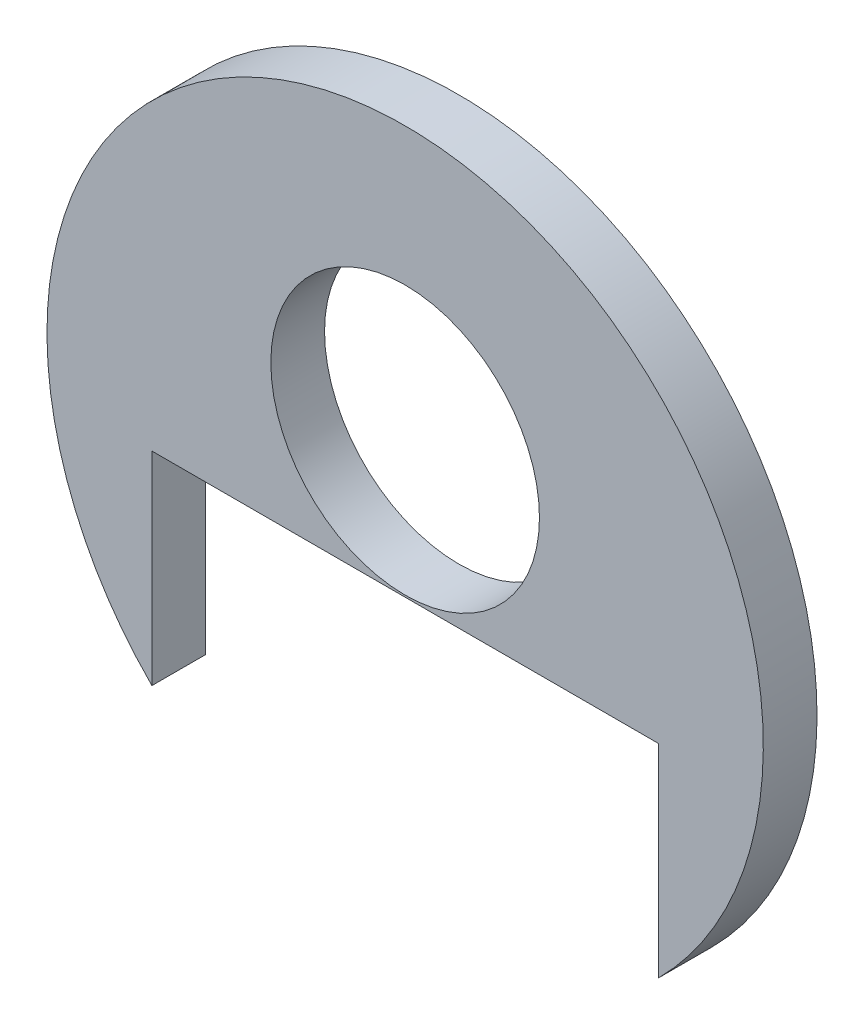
ISO-10303-21;
HEADER;
FILE_DESCRIPTION(('STEP AP214'),'2;1');
FILE_NAME('part.step','',(''),(''),'','','');
FILE_SCHEMA(('AUTOMOTIVE_DESIGN { 1 0 10303 214 1 1 1 1 }'));
ENDSEC;
DATA;
#1=APPLICATION_CONTEXT('core data for automotive mechanical design processes');
#2=APPLICATION_PROTOCOL_DEFINITION('international standard','automotive_design',2000,#1);
#3=PRODUCT_CONTEXT('',#1,'mechanical');
#4=PRODUCT('Part','Part','',(#3));
#5=PRODUCT_RELATED_PRODUCT_CATEGORY('part','',(#4));
#6=PRODUCT_DEFINITION_FORMATION('','',#4);
#7=PRODUCT_DEFINITION_CONTEXT('part definition',#1,'design');
#8=PRODUCT_DEFINITION('design','',#6,#7);
#9=PRODUCT_DEFINITION_SHAPE('','',#8);
#10=(LENGTH_UNIT() NAMED_UNIT(*) SI_UNIT(.MILLI.,.METRE.));
#11=(NAMED_UNIT(*) PLANE_ANGLE_UNIT() SI_UNIT($,.RADIAN.));
#12=(NAMED_UNIT(*) SI_UNIT($,.STERADIAN.) SOLID_ANGLE_UNIT());
#13=UNCERTAINTY_MEASURE_WITH_UNIT(LENGTH_MEASURE(1.E-05),#10,'distance_accuracy_value','');
#14=(GEOMETRIC_REPRESENTATION_CONTEXT(3) GLOBAL_UNCERTAINTY_ASSIGNED_CONTEXT((#13)) GLOBAL_UNIT_ASSIGNED_CONTEXT((#10,
#11,#12)) REPRESENTATION_CONTEXT('',''));
#15=CARTESIAN_POINT('',(0.,0.,0.));
#16=DIRECTION('',(0.,0.,1.));
#17=DIRECTION('',(1.,0.,0.));
#18=AXIS2_PLACEMENT_3D('',#15,#16,#17);
#19=CARTESIAN_POINT('',(0.,0.,-3.81));
#20=DIRECTION('',(0.,0.,1.));
#21=DIRECTION('',(1.,0.,0.));
#22=AXIS2_PLACEMENT_3D('',#19,#20,#21);
#23=CYLINDRICAL_SURFACE('',#22,25.4);
#24=DIRECTION('',(0.,0.,1.));
#25=VECTOR('',#24,1.);
#26=CARTESIAN_POINT('',(-17.9578,-17.963224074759,-3.81));
#27=LINE('',#26,#25);
#28=CARTESIAN_POINT('',(-17.9578,-17.963224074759,0.));
#29=VERTEX_POINT('',#28);
#30=CARTESIAN_POINT('',(-17.9578,-17.963224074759,-3.81));
#31=VERTEX_POINT('',#30);
#32=EDGE_CURVE('E52',#29,#31,#27,.F.);
#33=ORIENTED_EDGE('',*,*,#32,.F.);
#34=CARTESIAN_POINT('',(0.,0.,0.));
#35=DIRECTION('',(0.,0.,1.));
#36=DIRECTION('',(1.,0.,0.));
#37=AXIS2_PLACEMENT_3D('',#34,#35,#36);
#38=CIRCLE('',#37,25.4);
#39=CARTESIAN_POINT('',(17.9578,-17.963224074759,0.));
#40=VERTEX_POINT('',#39);
#41=EDGE_CURVE('E106',#40,#29,#38,.T.);
#42=ORIENTED_EDGE('',*,*,#41,.F.);
#43=DIRECTION('',(0.,0.,1.));
#44=VECTOR('',#43,1.);
#45=CARTESIAN_POINT('',(17.9578,-17.963224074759,-3.81));
#46=LINE('',#45,#44);
#47=CARTESIAN_POINT('',(17.9578,-17.963224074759,-3.81));
#48=VERTEX_POINT('',#47);
#49=EDGE_CURVE('E44',#48,#40,#46,.T.);
#50=ORIENTED_EDGE('',*,*,#49,.F.);
#51=CARTESIAN_POINT('',(0.,0.,-3.81));
#52=DIRECTION('',(0.,0.,1.));
#53=DIRECTION('',(1.,0.,0.));
#54=AXIS2_PLACEMENT_3D('',#51,#52,#53);
#55=CIRCLE('',#54,25.4);
#56=EDGE_CURVE('E38',#48,#31,#55,.T.);
#57=ORIENTED_EDGE('',*,*,#56,.T.);
#58=EDGE_LOOP('',(#33,#42,#50,#57));
#59=FACE_BOUND('',#58,.T.);
#60=ADVANCED_FACE('F31',(#59),#23,.T.);
#61=CARTESIAN_POINT('',(0.,0.,-3.81));
#62=DIRECTION('',(0.,0.,1.));
#63=DIRECTION('',(1.,0.,0.));
#64=AXIS2_PLACEMENT_3D('',#61,#62,#63);
#65=PLANE('',#64);
#66=CARTESIAN_POINT('',(0.,6.096,-3.81));
#67=DIRECTION('',(0.,0.,1.));
#68=DIRECTION('',(1.,0.,0.));
#69=AXIS2_PLACEMENT_3D('',#66,#67,#68);
#70=CIRCLE('',#69,9.525);
#71=CARTESIAN_POINT('',(9.525,6.096,-3.81));
#72=VERTEX_POINT('',#71);
#73=EDGE_CURVE('E103',#72,#72,#70,.T.);
#74=ORIENTED_EDGE('',*,*,#73,.T.);
#75=EDGE_LOOP('',(#74));
#76=FACE_BOUND('',#75,.T.);
#77=DIRECTION('',(-1.,0.,0.));
#78=VECTOR('',#77,1.);
#79=CARTESIAN_POINT('',(-17.9578,-3.556,-3.81));
#80=LINE('',#79,#78);
#81=CARTESIAN_POINT('',(17.9578,-3.556,-3.81));
#82=VERTEX_POINT('',#81);
#83=CARTESIAN_POINT('',(-17.9578,-3.556,-3.81));
#84=VERTEX_POINT('',#83);
#85=EDGE_CURVE('E82',#82,#84,#80,.T.);
#86=ORIENTED_EDGE('',*,*,#85,.T.);
#87=DIRECTION('',(0.,-1.,0.));
#88=VECTOR('',#87,1.);
#89=CARTESIAN_POINT('',(-17.9578,-3.556,-3.81));
#90=LINE('',#89,#88);
#91=EDGE_CURVE('E89',#84,#31,#90,.T.);
#92=ORIENTED_EDGE('',*,*,#91,.T.);
#93=ORIENTED_EDGE('',*,*,#56,.F.);
#94=DIRECTION('',(0.,1.,0.));
#95=VECTOR('',#94,1.);
#96=CARTESIAN_POINT('',(17.9578,-28.1051693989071,-3.81));
#97=LINE('',#96,#95);
#98=EDGE_CURVE('E91',#48,#82,#97,.T.);
#99=ORIENTED_EDGE('',*,*,#98,.T.);
#100=EDGE_LOOP('',(#86,#92,#93,#99));
#101=FACE_BOUND('',#100,.T.);
#102=ADVANCED_FACE('F111',(#76,#101),#65,.F.);
#103=CARTESIAN_POINT('',(0.,0.,0.));
#104=DIRECTION('',(0.,0.,1.));
#105=DIRECTION('',(1.,0.,0.));
#106=AXIS2_PLACEMENT_3D('',#103,#104,#105);
#107=PLANE('',#106);
#108=DIRECTION('',(0.,-1.,0.));
#109=VECTOR('',#108,1.);
#110=CARTESIAN_POINT('',(-17.9578,-3.556,0.));
#111=LINE('',#110,#109);
#112=CARTESIAN_POINT('',(-17.9578,-3.556,0.));
#113=VERTEX_POINT('',#112);
#114=EDGE_CURVE('E88',#113,#29,#111,.T.);
#115=ORIENTED_EDGE('',*,*,#114,.F.);
#116=DIRECTION('',(-1.,0.,0.));
#117=VECTOR('',#116,1.);
#118=CARTESIAN_POINT('',(-17.9578,-3.556,0.));
#119=LINE('',#118,#117);
#120=CARTESIAN_POINT('',(17.9578,-3.556,0.));
#121=VERTEX_POINT('',#120);
#122=EDGE_CURVE('E79',#121,#113,#119,.T.);
#123=ORIENTED_EDGE('',*,*,#122,.F.);
#124=DIRECTION('',(0.,1.,0.));
#125=VECTOR('',#124,1.);
#126=CARTESIAN_POINT('',(17.9578,0.,0.));
#127=LINE('',#126,#125);
#128=EDGE_CURVE('E11',#40,#121,#127,.T.);
#129=ORIENTED_EDGE('',*,*,#128,.F.);
#130=ORIENTED_EDGE('',*,*,#41,.T.);
#131=EDGE_LOOP('',(#115,#123,#129,#130));
#132=FACE_BOUND('',#131,.T.);
#133=CARTESIAN_POINT('',(0.,6.096,0.));
#134=DIRECTION('',(0.,0.,1.));
#135=DIRECTION('',(1.,0.,0.));
#136=AXIS2_PLACEMENT_3D('',#133,#134,#135);
#137=CIRCLE('',#136,9.525);
#138=CARTESIAN_POINT('',(9.525,6.096,0.));
#139=VERTEX_POINT('',#138);
#140=EDGE_CURVE('E100',#139,#139,#137,.T.);
#141=ORIENTED_EDGE('',*,*,#140,.F.);
#142=EDGE_LOOP('',(#141));
#143=FACE_BOUND('',#142,.T.);
#144=ADVANCED_FACE('F86',(#132,#143),#107,.T.);
#145=CARTESIAN_POINT('',(0.,6.096,-3.81));
#146=DIRECTION('',(0.,0.,1.));
#147=DIRECTION('',(1.,0.,0.));
#148=AXIS2_PLACEMENT_3D('',#145,#146,#147);
#149=CYLINDRICAL_SURFACE('',#148,9.525);
#150=CARTESIAN_POINT('',(9.525,6.096,-3.81));
#151=CARTESIAN_POINT('',(9.525,6.096,-3.7703125));
#152=CARTESIAN_POINT('',(9.525,6.096,-3.730625));
#153=CARTESIAN_POINT('',(9.525,6.096,-3.65125));
#154=CARTESIAN_POINT('',(9.525,6.096,-3.6115625));
#155=CARTESIAN_POINT('',(9.525,6.096,-3.5321875));
#156=CARTESIAN_POINT('',(9.525,6.096,-3.4925));
#157=CARTESIAN_POINT('',(9.525,6.096,-3.413125));
#158=CARTESIAN_POINT('',(9.525,6.096,-3.3734375));
#159=CARTESIAN_POINT('',(9.525,6.096,-3.2940625));
#160=CARTESIAN_POINT('',(9.525,6.096,-3.254375));
#161=CARTESIAN_POINT('',(9.525,6.096,-3.175));
#162=CARTESIAN_POINT('',(9.525,6.096,-3.1353125));
#163=CARTESIAN_POINT('',(9.525,6.096,-3.0559375));
#164=CARTESIAN_POINT('',(9.525,6.096,-3.01625));
#165=CARTESIAN_POINT('',(9.525,6.096,-2.936875));
#166=CARTESIAN_POINT('',(9.525,6.096,-2.8971875));
#167=CARTESIAN_POINT('',(9.525,6.096,-2.8178125));
#168=CARTESIAN_POINT('',(9.525,6.096,-2.778125));
#169=CARTESIAN_POINT('',(9.525,6.096,-2.69875));
#170=CARTESIAN_POINT('',(9.525,6.096,-2.6590625));
#171=CARTESIAN_POINT('',(9.525,6.096,-2.5796875));
#172=CARTESIAN_POINT('',(9.525,6.096,-2.54));
#173=CARTESIAN_POINT('',(9.525,6.096,-2.460625));
#174=CARTESIAN_POINT('',(9.525,6.096,-2.4209375));
#175=CARTESIAN_POINT('',(9.525,6.096,-2.3415625));
#176=CARTESIAN_POINT('',(9.525,6.096,-2.301875));
#177=CARTESIAN_POINT('',(9.525,6.096,-2.2225));
#178=CARTESIAN_POINT('',(9.525,6.096,-2.1828125));
#179=CARTESIAN_POINT('',(9.525,6.096,-2.1034375));
#180=CARTESIAN_POINT('',(9.525,6.096,-2.06375));
#181=CARTESIAN_POINT('',(9.525,6.096,-1.984375));
#182=CARTESIAN_POINT('',(9.525,6.096,-1.9446875));
#183=CARTESIAN_POINT('',(9.525,6.096,-1.8653125));
#184=CARTESIAN_POINT('',(9.525,6.096,-1.825625));
#185=CARTESIAN_POINT('',(9.525,6.096,-1.74625));
#186=CARTESIAN_POINT('',(9.525,6.096,-1.7065625));
#187=CARTESIAN_POINT('',(9.525,6.096,-1.6271875));
#188=CARTESIAN_POINT('',(9.525,6.096,-1.5875));
#189=CARTESIAN_POINT('',(9.525,6.096,-1.508125));
#190=CARTESIAN_POINT('',(9.525,6.096,-1.4684375));
#191=CARTESIAN_POINT('',(9.525,6.096,-1.3890625));
#192=CARTESIAN_POINT('',(9.525,6.096,-1.349375));
#193=CARTESIAN_POINT('',(9.525,6.096,-1.27));
#194=CARTESIAN_POINT('',(9.525,6.096,-1.2303125));
#195=CARTESIAN_POINT('',(9.525,6.096,-1.1509375));
#196=CARTESIAN_POINT('',(9.525,6.096,-1.11125));
#197=CARTESIAN_POINT('',(9.525,6.096,-1.031875));
#198=CARTESIAN_POINT('',(9.525,6.096,-0.9921875));
#199=CARTESIAN_POINT('',(9.525,6.096,-0.9128125));
#200=CARTESIAN_POINT('',(9.525,6.096,-0.873125));
#201=CARTESIAN_POINT('',(9.525,6.096,-0.79375));
#202=CARTESIAN_POINT('',(9.525,6.096,-0.7540625));
#203=CARTESIAN_POINT('',(9.525,6.096,-0.6746875));
#204=CARTESIAN_POINT('',(9.525,6.096,-0.635));
#205=CARTESIAN_POINT('',(9.525,6.096,-0.555625));
#206=CARTESIAN_POINT('',(9.525,6.096,-0.5159375));
#207=CARTESIAN_POINT('',(9.525,6.096,-0.4365625));
#208=CARTESIAN_POINT('',(9.525,6.096,-0.396875));
#209=CARTESIAN_POINT('',(9.525,6.096,-0.3175));
#210=CARTESIAN_POINT('',(9.525,6.096,-0.2778125));
#211=CARTESIAN_POINT('',(9.525,6.096,-0.1984375));
#212=CARTESIAN_POINT('',(9.525,6.096,-0.15875));
#213=CARTESIAN_POINT('',(9.525,6.096,-0.0793749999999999));
#214=CARTESIAN_POINT('',(9.525,6.096,-0.0396874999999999));
#215=CARTESIAN_POINT('',(9.525,6.096,0.));
#216=B_SPLINE_CURVE_WITH_KNOTS('',3,(#150,#151,#152,#153,#154,#155,#156,#157,#158,#159,#160,
#161,#162,#163,#164,#165,#166,#167,#168,#169,#170,#171,#172,#173,#174,#175,#176,#177,#178,#179,
#180,#181,#182,#183,#184,#185,#186,#187,#188,#189,#190,#191,#192,#193,#194,#195,#196,#197,#198,
#199,#200,#201,#202,#203,#204,#205,#206,#207,#208,#209,#210,#211,#212,#213,#214,#215),
.UNSPECIFIED.,.F.,.F.,(4,2,2,2,2,2,2,2,2,2,2,2,2,2,2,2,2,2,2,2,2,2,2,2,2,2,2,2,2,2,2,2,4),(0.,
0.1190625,0.238125,0.3571875,0.47625,0.5953125,0.714375,0.833437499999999,0.9525,1.0715625,
1.190625,1.3096875,1.42875,1.5478125,1.666875,1.7859375,1.905,2.0240625,2.143125,2.2621875,
2.38125,2.5003125,2.619375,2.7384375,2.8575,2.9765625,3.095625,3.2146875,3.33375,3.4528125,
3.571875,3.6909375,3.81),.UNSPECIFIED.);
#217=EDGE_CURVE('BSEAM114',#72,#139,#216,.T.);
#218=ORIENTED_EDGE('',*,*,#73,.F.);
#219=ORIENTED_EDGE('',*,*,#140,.T.);
#220=ORIENTED_EDGE('',*,*,#217,.T.);
#221=ORIENTED_EDGE('',*,*,#217,.F.);
#222=EDGE_LOOP('',(#218,#220,#219,#221));
#223=FACE_BOUND('',#222,.T.);
#224=ADVANCED_FACE('F114',(#223),#149,.F.);
#225=CARTESIAN_POINT('',(-17.9578,-3.556,-3.81));
#226=DIRECTION('',(-1.,0.,0.));
#227=DIRECTION('',(0.,-1.,0.));
#228=AXIS2_PLACEMENT_3D('',#225,#226,#227);
#229=PLANE('',#228);
#230=ORIENTED_EDGE('',*,*,#32,.T.);
#231=ORIENTED_EDGE('',*,*,#91,.F.);
#232=DIRECTION('',(0.,0.,1.));
#233=VECTOR('',#232,1.);
#234=CARTESIAN_POINT('',(-17.9578,-3.556,-3.81));
#235=LINE('',#234,#233);
#236=EDGE_CURVE('E84',#84,#113,#235,.T.);
#237=ORIENTED_EDGE('',*,*,#236,.T.);
#238=ORIENTED_EDGE('',*,*,#114,.T.);
#239=EDGE_LOOP('',(#230,#231,#237,#238));
#240=FACE_BOUND('',#239,.T.);
#241=ADVANCED_FACE('F112',(#240),#229,.F.);
#242=CARTESIAN_POINT('',(-17.9578,-3.556,-3.81));
#243=DIRECTION('',(0.,1.,0.));
#244=DIRECTION('',(-1.,0.,0.));
#245=AXIS2_PLACEMENT_3D('',#242,#243,#244);
#246=PLANE('',#245);
#247=ORIENTED_EDGE('',*,*,#122,.T.);
#248=ORIENTED_EDGE('',*,*,#236,.F.);
#249=ORIENTED_EDGE('',*,*,#85,.F.);
#250=DIRECTION('',(0.,0.,1.));
#251=VECTOR('',#250,1.);
#252=CARTESIAN_POINT('',(17.9578,-3.556,-3.81));
#253=LINE('',#252,#251);
#254=EDGE_CURVE('E70',#82,#121,#253,.T.);
#255=ORIENTED_EDGE('',*,*,#254,.T.);
#256=EDGE_LOOP('',(#247,#248,#249,#255));
#257=FACE_BOUND('',#256,.T.);
#258=ADVANCED_FACE('F78',(#257),#246,.F.);
#259=CARTESIAN_POINT('',(17.9578,-28.1051693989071,-3.81));
#260=DIRECTION('',(1.,0.,0.));
#261=DIRECTION('',(0.,0.,-1.));
#262=AXIS2_PLACEMENT_3D('',#259,#260,#261);
#263=PLANE('',#262);
#264=ORIENTED_EDGE('',*,*,#49,.T.);
#265=ORIENTED_EDGE('',*,*,#128,.T.);
#266=ORIENTED_EDGE('',*,*,#254,.F.);
#267=ORIENTED_EDGE('',*,*,#98,.F.);
#268=EDGE_LOOP('',(#264,#265,#266,#267));
#269=FACE_BOUND('',#268,.T.);
#270=ADVANCED_FACE('F69',(#269),#263,.F.);
#271=CLOSED_SHELL('',(#60,#102,#144,#224,#241,#258,#270));
#272=MANIFOLD_SOLID_BREP('B2',#271);
#273=ADVANCED_BREP_SHAPE_REPRESENTATION('',(#18,#272),#14);
#274=SHAPE_DEFINITION_REPRESENTATION(#9,#273);
ENDSEC;
END-ISO-10303-21;
